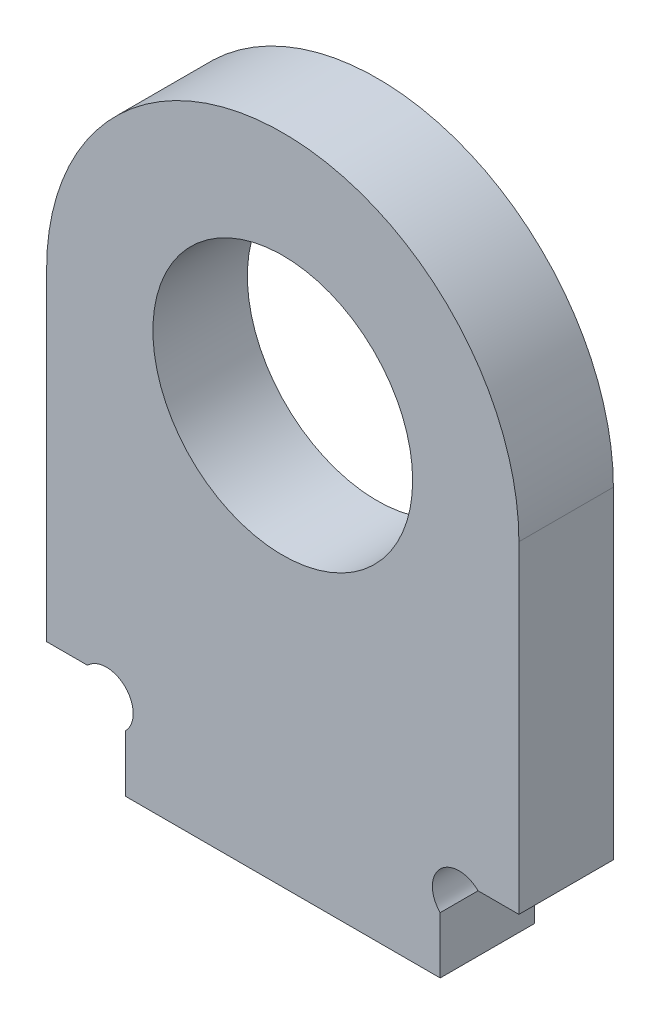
from build123d import *

# Parameters (mm, degrees)
ESQUISSE1_R      = 8.25
EXTRUSION1_DEPTH = 6


with BuildPart() as part:
    # Esquisse1 → Extrusion1 (new body)
    with BuildSketch(Plane.XY):
        with BuildLine():
            Line((0, 26.5), (0, 6))
            Line((0, 6), (2.595836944, 6))
            ThreePointArc((2.595836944, 6), (5, 6), (5, 3.595836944))
            Line((5, 3.595836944), (5, 0))
            Line((5, 0), (25, 0))
            Line((25, 0), (25, 3.595836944))
            ThreePointArc((25, 3.595836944), (25, 6), (27.404163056, 6))
            Line((27.404163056, 6), (30, 6))
            Line((30, 6), (30, 26.5))
            ThreePointArc((30, 26.5), (15, 41.5), (0, 26.5))
        make_face()
        with Locations((15, 26.5)):
            Circle(ESQUISSE1_R, mode=Mode.SUBTRACT)
    extrude(amount=EXTRUSION1_DEPTH)


solid = part.part
